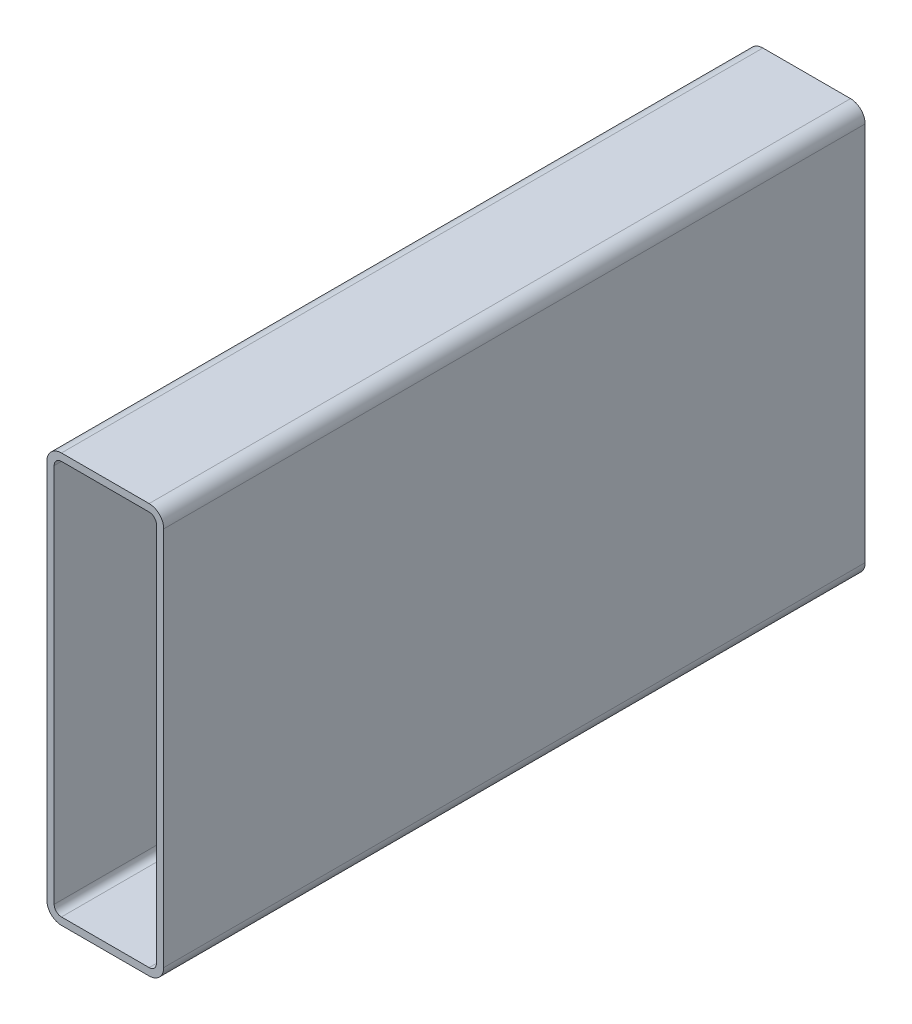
ISO-10303-21;
HEADER;
FILE_DESCRIPTION(('STEP AP214'),'2;1');
FILE_NAME('part.step','',(''),(''),'','','');
FILE_SCHEMA(('AUTOMOTIVE_DESIGN { 1 0 10303 214 1 1 1 1 }'));
ENDSEC;
DATA;
#1=APPLICATION_CONTEXT('core data for automotive mechanical design processes');
#2=APPLICATION_PROTOCOL_DEFINITION('international standard','automotive_design',2000,#1);
#3=PRODUCT_CONTEXT('',#1,'mechanical');
#4=PRODUCT('Part','Part','',(#3));
#5=PRODUCT_RELATED_PRODUCT_CATEGORY('part','',(#4));
#6=PRODUCT_DEFINITION_FORMATION('','',#4);
#7=PRODUCT_DEFINITION_CONTEXT('part definition',#1,'design');
#8=PRODUCT_DEFINITION('design','',#6,#7);
#9=PRODUCT_DEFINITION_SHAPE('','',#8);
#10=(LENGTH_UNIT() NAMED_UNIT(*) SI_UNIT(.MILLI.,.METRE.));
#11=(NAMED_UNIT(*) PLANE_ANGLE_UNIT() SI_UNIT($,.RADIAN.));
#12=(NAMED_UNIT(*) SI_UNIT($,.STERADIAN.) SOLID_ANGLE_UNIT());
#13=UNCERTAINTY_MEASURE_WITH_UNIT(LENGTH_MEASURE(1.E-05),#10,'distance_accuracy_value','');
#14=(GEOMETRIC_REPRESENTATION_CONTEXT(3) GLOBAL_UNCERTAINTY_ASSIGNED_CONTEXT((#13)) GLOBAL_UNIT_ASSIGNED_CONTEXT((#10,
#11,#12)) REPRESENTATION_CONTEXT('',''));
#15=CARTESIAN_POINT('',(0.,0.,0.));
#16=DIRECTION('',(0.,0.,1.));
#17=DIRECTION('',(1.,0.,0.));
#18=AXIS2_PLACEMENT_3D('',#15,#16,#17);
#19=CARTESIAN_POINT('',(6.35,171.45,304.8));
#20=DIRECTION('',(0.,0.,1.));
#21=DIRECTION('',(1.,0.,0.));
#22=AXIS2_PLACEMENT_3D('',#19,#20,#21);
#23=PLANE('',#22);
#24=CARTESIAN_POINT('',(6.35,171.45,304.8));
#25=DIRECTION('',(0.,0.,1.));
#26=DIRECTION('',(1.,0.,0.));
#27=AXIS2_PLACEMENT_3D('',#24,#25,#26);
#28=CIRCLE('',#27,6.35);
#29=CARTESIAN_POINT('',(6.35,177.8,304.8));
#30=VERTEX_POINT('',#29);
#31=CARTESIAN_POINT('',(0.,171.45,304.8));
#32=VERTEX_POINT('',#31);
#33=EDGE_CURVE('E211',#30,#32,#28,.T.);
#34=ORIENTED_EDGE('',*,*,#33,.T.);
#35=DIRECTION('',(0.,-1.,0.));
#36=VECTOR('',#35,1.);
#37=CARTESIAN_POINT('',(0.,6.35,304.8));
#38=LINE('',#37,#36);
#39=CARTESIAN_POINT('',(0.,6.35,304.8));
#40=VERTEX_POINT('',#39);
#41=EDGE_CURVE('E214',#32,#40,#38,.T.);
#42=ORIENTED_EDGE('',*,*,#41,.T.);
#43=CARTESIAN_POINT('',(6.35,6.35,304.8));
#44=DIRECTION('',(0.,0.,1.));
#45=DIRECTION('',(1.,0.,0.));
#46=AXIS2_PLACEMENT_3D('',#43,#44,#45);
#47=CIRCLE('',#46,6.35);
#48=CARTESIAN_POINT('',(6.35,0.,304.8));
#49=VERTEX_POINT('',#48);
#50=EDGE_CURVE('E217',#40,#49,#47,.T.);
#51=ORIENTED_EDGE('',*,*,#50,.T.);
#52=DIRECTION('',(1.,0.,0.));
#53=VECTOR('',#52,1.);
#54=CARTESIAN_POINT('',(44.45,0.,304.8));
#55=LINE('',#54,#53);
#56=CARTESIAN_POINT('',(44.45,0.,304.8));
#57=VERTEX_POINT('',#56);
#58=EDGE_CURVE('E219',#49,#57,#55,.T.);
#59=ORIENTED_EDGE('',*,*,#58,.T.);
#60=CARTESIAN_POINT('',(44.45,6.35,304.8));
#61=DIRECTION('',(0.,0.,1.));
#62=DIRECTION('',(1.,0.,0.));
#63=AXIS2_PLACEMENT_3D('',#60,#61,#62);
#64=CIRCLE('',#63,6.35);
#65=CARTESIAN_POINT('',(50.8,6.35,304.8));
#66=VERTEX_POINT('',#65);
#67=EDGE_CURVE('E221',#57,#66,#64,.T.);
#68=ORIENTED_EDGE('',*,*,#67,.T.);
#69=DIRECTION('',(0.,1.,0.));
#70=VECTOR('',#69,1.);
#71=CARTESIAN_POINT('',(50.8,171.45,304.8));
#72=LINE('',#71,#70);
#73=CARTESIAN_POINT('',(50.8,171.45,304.8));
#74=VERTEX_POINT('',#73);
#75=EDGE_CURVE('E223',#66,#74,#72,.T.);
#76=ORIENTED_EDGE('',*,*,#75,.T.);
#77=CARTESIAN_POINT('',(44.45,171.45,304.8));
#78=DIRECTION('',(0.,0.,1.));
#79=DIRECTION('',(1.,0.,0.));
#80=AXIS2_PLACEMENT_3D('',#77,#78,#79);
#81=CIRCLE('',#80,6.35);
#82=CARTESIAN_POINT('',(44.45,177.8,304.8));
#83=VERTEX_POINT('',#82);
#84=EDGE_CURVE('E225',#74,#83,#81,.T.);
#85=ORIENTED_EDGE('',*,*,#84,.T.);
#86=DIRECTION('',(-1.,0.,0.));
#87=VECTOR('',#86,1.);
#88=CARTESIAN_POINT('',(6.35,177.8,304.8));
#89=LINE('',#88,#87);
#90=EDGE_CURVE('E227',#83,#30,#89,.T.);
#91=ORIENTED_EDGE('',*,*,#90,.T.);
#92=EDGE_LOOP('',(#34,#42,#51,#59,#68,#76,#85,#91));
#93=FACE_BOUND('',#92,.T.);
#94=DIRECTION('',(0.,-1.,0.));
#95=VECTOR('',#94,1.);
#96=CARTESIAN_POINT('',(3.175,6.35,304.8));
#97=LINE('',#96,#95);
#98=CARTESIAN_POINT('',(3.175,171.45,304.8));
#99=VERTEX_POINT('',#98);
#100=CARTESIAN_POINT('',(3.175,6.35,304.8));
#101=VERTEX_POINT('',#100);
#102=EDGE_CURVE('E154',#99,#101,#97,.T.);
#103=ORIENTED_EDGE('',*,*,#102,.F.);
#104=CARTESIAN_POINT('',(6.35,171.45,304.8));
#105=DIRECTION('',(0.,0.,1.));
#106=DIRECTION('',(1.,0.,0.));
#107=AXIS2_PLACEMENT_3D('',#104,#105,#106);
#108=CIRCLE('',#107,3.17500000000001);
#109=CARTESIAN_POINT('',(6.35,174.625,304.8));
#110=VERTEX_POINT('',#109);
#111=EDGE_CURVE('E146',#110,#99,#108,.T.);
#112=ORIENTED_EDGE('',*,*,#111,.F.);
#113=DIRECTION('',(-1.,0.,0.));
#114=VECTOR('',#113,1.);
#115=CARTESIAN_POINT('',(6.35,174.625,304.8));
#116=LINE('',#115,#114);
#117=CARTESIAN_POINT('',(44.45,174.625,304.8));
#118=VERTEX_POINT('',#117);
#119=EDGE_CURVE('E179',#118,#110,#116,.T.);
#120=ORIENTED_EDGE('',*,*,#119,.F.);
#121=CARTESIAN_POINT('',(44.45,171.45,304.8));
#122=DIRECTION('',(0.,0.,1.));
#123=DIRECTION('',(1.,0.,0.));
#124=AXIS2_PLACEMENT_3D('',#121,#122,#123);
#125=CIRCLE('',#124,3.17500000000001);
#126=CARTESIAN_POINT('',(47.625,171.45,304.8));
#127=VERTEX_POINT('',#126);
#128=EDGE_CURVE('E177',#127,#118,#125,.T.);
#129=ORIENTED_EDGE('',*,*,#128,.F.);
#130=DIRECTION('',(0.,1.,0.));
#131=VECTOR('',#130,1.);
#132=CARTESIAN_POINT('',(47.625,171.45,304.8));
#133=LINE('',#132,#131);
#134=CARTESIAN_POINT('',(47.625,6.35,304.8));
#135=VERTEX_POINT('',#134);
#136=EDGE_CURVE('E175',#135,#127,#133,.T.);
#137=ORIENTED_EDGE('',*,*,#136,.F.);
#138=CARTESIAN_POINT('',(44.45,6.35,304.8));
#139=DIRECTION('',(0.,0.,1.));
#140=DIRECTION('',(1.,0.,0.));
#141=AXIS2_PLACEMENT_3D('',#138,#139,#140);
#142=CIRCLE('',#141,3.175);
#143=CARTESIAN_POINT('',(44.45,3.175,304.8));
#144=VERTEX_POINT('',#143);
#145=EDGE_CURVE('E173',#144,#135,#142,.T.);
#146=ORIENTED_EDGE('',*,*,#145,.F.);
#147=DIRECTION('',(1.,0.,0.));
#148=VECTOR('',#147,1.);
#149=CARTESIAN_POINT('',(44.45,3.175,304.8));
#150=LINE('',#149,#148);
#151=CARTESIAN_POINT('',(6.35,3.175,304.8));
#152=VERTEX_POINT('',#151);
#153=EDGE_CURVE('E169',#152,#144,#150,.T.);
#154=ORIENTED_EDGE('',*,*,#153,.F.);
#155=CARTESIAN_POINT('',(6.35,6.35,304.8));
#156=DIRECTION('',(0.,0.,1.));
#157=DIRECTION('',(1.,0.,0.));
#158=AXIS2_PLACEMENT_3D('',#155,#156,#157);
#159=CIRCLE('',#158,3.175);
#160=EDGE_CURVE('E167',#101,#152,#159,.T.);
#161=ORIENTED_EDGE('',*,*,#160,.F.);
#162=EDGE_LOOP('',(#103,#112,#120,#129,#137,#146,#154,#161));
#163=FACE_BOUND('',#162,.T.);
#164=ADVANCED_FACE('F33',(#93,#163),#23,.T.);
#165=CARTESIAN_POINT('',(6.35,171.45,0.));
#166=DIRECTION('',(0.,0.,1.));
#167=DIRECTION('',(1.,0.,0.));
#168=AXIS2_PLACEMENT_3D('',#165,#166,#167);
#169=PLANE('',#168);
#170=CARTESIAN_POINT('',(6.35,171.45,0.));
#171=DIRECTION('',(0.,0.,1.));
#172=DIRECTION('',(1.,0.,0.));
#173=AXIS2_PLACEMENT_3D('',#170,#171,#172);
#174=CIRCLE('',#173,6.35);
#175=CARTESIAN_POINT('',(6.35,177.8,0.));
#176=VERTEX_POINT('',#175);
#177=CARTESIAN_POINT('',(0.,171.45,0.));
#178=VERTEX_POINT('',#177);
#179=EDGE_CURVE('E162',#176,#178,#174,.T.);
#180=ORIENTED_EDGE('',*,*,#179,.F.);
#181=DIRECTION('',(-1.,0.,0.));
#182=VECTOR('',#181,1.);
#183=CARTESIAN_POINT('',(6.35,177.8,0.));
#184=LINE('',#183,#182);
#185=CARTESIAN_POINT('',(44.45,177.8,0.));
#186=VERTEX_POINT('',#185);
#187=EDGE_CURVE('E215',#186,#176,#184,.T.);
#188=ORIENTED_EDGE('',*,*,#187,.F.);
#189=CARTESIAN_POINT('',(44.45,171.45,0.));
#190=DIRECTION('',(0.,0.,1.));
#191=DIRECTION('',(1.,0.,0.));
#192=AXIS2_PLACEMENT_3D('',#189,#190,#191);
#193=CIRCLE('',#192,6.35);
#194=CARTESIAN_POINT('',(50.8,171.45,0.));
#195=VERTEX_POINT('',#194);
#196=EDGE_CURVE('E242',#195,#186,#193,.T.);
#197=ORIENTED_EDGE('',*,*,#196,.F.);
#198=DIRECTION('',(0.,1.,0.));
#199=VECTOR('',#198,1.);
#200=CARTESIAN_POINT('',(50.8,171.45,0.));
#201=LINE('',#200,#199);
#202=CARTESIAN_POINT('',(50.8,6.35,0.));
#203=VERTEX_POINT('',#202);
#204=EDGE_CURVE('E240',#203,#195,#201,.T.);
#205=ORIENTED_EDGE('',*,*,#204,.F.);
#206=CARTESIAN_POINT('',(44.45,6.35,0.));
#207=DIRECTION('',(0.,0.,1.));
#208=DIRECTION('',(1.,0.,0.));
#209=AXIS2_PLACEMENT_3D('',#206,#207,#208);
#210=CIRCLE('',#209,6.35);
#211=CARTESIAN_POINT('',(44.45,0.,0.));
#212=VERTEX_POINT('',#211);
#213=EDGE_CURVE('E238',#212,#203,#210,.T.);
#214=ORIENTED_EDGE('',*,*,#213,.F.);
#215=DIRECTION('',(1.,0.,0.));
#216=VECTOR('',#215,1.);
#217=CARTESIAN_POINT('',(44.45,0.,0.));
#218=LINE('',#217,#216);
#219=CARTESIAN_POINT('',(6.35,0.,0.));
#220=VERTEX_POINT('',#219);
#221=EDGE_CURVE('E236',#220,#212,#218,.T.);
#222=ORIENTED_EDGE('',*,*,#221,.F.);
#223=CARTESIAN_POINT('',(6.35,6.35,0.));
#224=DIRECTION('',(0.,0.,1.));
#225=DIRECTION('',(1.,0.,0.));
#226=AXIS2_PLACEMENT_3D('',#223,#224,#225);
#227=CIRCLE('',#226,6.35);
#228=CARTESIAN_POINT('',(0.,6.35,0.));
#229=VERTEX_POINT('',#228);
#230=EDGE_CURVE('E234',#229,#220,#227,.T.);
#231=ORIENTED_EDGE('',*,*,#230,.F.);
#232=DIRECTION('',(0.,-1.,0.));
#233=VECTOR('',#232,1.);
#234=CARTESIAN_POINT('',(0.,6.35,0.));
#235=LINE('',#234,#233);
#236=EDGE_CURVE('E232',#178,#229,#235,.T.);
#237=ORIENTED_EDGE('',*,*,#236,.F.);
#238=EDGE_LOOP('',(#180,#188,#197,#205,#214,#222,#231,#237));
#239=FACE_BOUND('',#238,.T.);
#240=CARTESIAN_POINT('',(6.35,171.45,0.));
#241=DIRECTION('',(0.,0.,1.));
#242=DIRECTION('',(1.,0.,0.));
#243=AXIS2_PLACEMENT_3D('',#240,#241,#242);
#244=CIRCLE('',#243,3.17500000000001);
#245=CARTESIAN_POINT('',(6.35,174.625,0.));
#246=VERTEX_POINT('',#245);
#247=CARTESIAN_POINT('',(3.175,171.45,0.));
#248=VERTEX_POINT('',#247);
#249=EDGE_CURVE('E56',#246,#248,#244,.T.);
#250=ORIENTED_EDGE('',*,*,#249,.T.);
#251=DIRECTION('',(0.,-1.,0.));
#252=VECTOR('',#251,1.);
#253=CARTESIAN_POINT('',(3.175,6.35,0.));
#254=LINE('',#253,#252);
#255=CARTESIAN_POINT('',(3.175,6.35,0.));
#256=VERTEX_POINT('',#255);
#257=EDGE_CURVE('E161',#248,#256,#254,.T.);
#258=ORIENTED_EDGE('',*,*,#257,.T.);
#259=CARTESIAN_POINT('',(6.35,6.35,0.));
#260=DIRECTION('',(0.,0.,1.));
#261=DIRECTION('',(1.,0.,0.));
#262=AXIS2_PLACEMENT_3D('',#259,#260,#261);
#263=CIRCLE('',#262,3.175);
#264=CARTESIAN_POINT('',(6.35,3.175,0.));
#265=VERTEX_POINT('',#264);
#266=EDGE_CURVE('E183',#256,#265,#263,.T.);
#267=ORIENTED_EDGE('',*,*,#266,.T.);
#268=DIRECTION('',(1.,0.,0.));
#269=VECTOR('',#268,1.);
#270=CARTESIAN_POINT('',(44.45,3.175,0.));
#271=LINE('',#270,#269);
#272=CARTESIAN_POINT('',(44.45,3.175,0.));
#273=VERTEX_POINT('',#272);
#274=EDGE_CURVE('E186',#265,#273,#271,.T.);
#275=ORIENTED_EDGE('',*,*,#274,.T.);
#276=CARTESIAN_POINT('',(44.45,6.35,0.));
#277=DIRECTION('',(0.,0.,1.));
#278=DIRECTION('',(1.,0.,0.));
#279=AXIS2_PLACEMENT_3D('',#276,#277,#278);
#280=CIRCLE('',#279,3.175);
#281=CARTESIAN_POINT('',(47.625,6.35,0.));
#282=VERTEX_POINT('',#281);
#283=EDGE_CURVE('E189',#273,#282,#280,.T.);
#284=ORIENTED_EDGE('',*,*,#283,.T.);
#285=DIRECTION('',(0.,1.,0.));
#286=VECTOR('',#285,1.);
#287=CARTESIAN_POINT('',(47.625,171.45,0.));
#288=LINE('',#287,#286);
#289=CARTESIAN_POINT('',(47.625,171.45,0.));
#290=VERTEX_POINT('',#289);
#291=EDGE_CURVE('E192',#282,#290,#288,.T.);
#292=ORIENTED_EDGE('',*,*,#291,.T.);
#293=CARTESIAN_POINT('',(44.45,171.45,0.));
#294=DIRECTION('',(0.,0.,1.));
#295=DIRECTION('',(1.,0.,0.));
#296=AXIS2_PLACEMENT_3D('',#293,#294,#295);
#297=CIRCLE('',#296,3.17500000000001);
#298=CARTESIAN_POINT('',(44.45,174.625,0.));
#299=VERTEX_POINT('',#298);
#300=EDGE_CURVE('E195',#290,#299,#297,.T.);
#301=ORIENTED_EDGE('',*,*,#300,.T.);
#302=DIRECTION('',(-1.,0.,0.));
#303=VECTOR('',#302,1.);
#304=CARTESIAN_POINT('',(6.35,174.625,0.));
#305=LINE('',#304,#303);
#306=EDGE_CURVE('E155',#299,#246,#305,.T.);
#307=ORIENTED_EDGE('',*,*,#306,.T.);
#308=EDGE_LOOP('',(#250,#258,#267,#275,#284,#292,#301,#307));
#309=FACE_BOUND('',#308,.T.);
#310=ADVANCED_FACE('F272',(#239,#309),#169,.F.);
#311=CARTESIAN_POINT('',(6.35,171.45,304.8));
#312=DIRECTION('',(0.,0.,-1.));
#313=DIRECTION('',(-1.,0.,0.));
#314=AXIS2_PLACEMENT_3D('',#311,#312,#313);
#315=CYLINDRICAL_SURFACE('',#314,6.35);
#316=ORIENTED_EDGE('',*,*,#179,.T.);
#317=DIRECTION('',(0.,0.,-1.));
#318=VECTOR('',#317,1.);
#319=CARTESIAN_POINT('',(0.,171.45,304.8));
#320=LINE('',#319,#318);
#321=EDGE_CURVE('E11',#32,#178,#320,.T.);
#322=ORIENTED_EDGE('',*,*,#321,.F.);
#323=ORIENTED_EDGE('',*,*,#33,.F.);
#324=DIRECTION('',(0.,0.,-1.));
#325=VECTOR('',#324,1.);
#326=CARTESIAN_POINT('',(6.35,177.8,304.8));
#327=LINE('',#326,#325);
#328=EDGE_CURVE('E229',#30,#176,#327,.T.);
#329=ORIENTED_EDGE('',*,*,#328,.T.);
#330=EDGE_LOOP('',(#316,#322,#323,#329));
#331=FACE_BOUND('',#330,.T.);
#332=ADVANCED_FACE('F35',(#331),#315,.T.);
#333=CARTESIAN_POINT('',(0.,6.35,304.8));
#334=DIRECTION('',(1.,0.,0.));
#335=DIRECTION('',(0.,0.,-1.));
#336=AXIS2_PLACEMENT_3D('',#333,#334,#335);
#337=PLANE('',#336);
#338=ORIENTED_EDGE('',*,*,#236,.T.);
#339=DIRECTION('',(0.,0.,-1.));
#340=VECTOR('',#339,1.);
#341=CARTESIAN_POINT('',(0.,6.35,304.8));
#342=LINE('',#341,#340);
#343=EDGE_CURVE('E41',#40,#229,#342,.T.);
#344=ORIENTED_EDGE('',*,*,#343,.F.);
#345=ORIENTED_EDGE('',*,*,#41,.F.);
#346=ORIENTED_EDGE('',*,*,#321,.T.);
#347=EDGE_LOOP('',(#338,#344,#345,#346));
#348=FACE_BOUND('',#347,.T.);
#349=ADVANCED_FACE('F289',(#348),#337,.F.);
#350=CARTESIAN_POINT('',(6.35,6.35,304.8));
#351=DIRECTION('',(0.,0.,-1.));
#352=DIRECTION('',(-1.,0.,0.));
#353=AXIS2_PLACEMENT_3D('',#350,#351,#352);
#354=CYLINDRICAL_SURFACE('',#353,6.35);
#355=ORIENTED_EDGE('',*,*,#230,.T.);
#356=DIRECTION('',(0.,0.,-1.));
#357=VECTOR('',#356,1.);
#358=CARTESIAN_POINT('',(6.35,0.,304.8));
#359=LINE('',#358,#357);
#360=EDGE_CURVE('E259',#49,#220,#359,.T.);
#361=ORIENTED_EDGE('',*,*,#360,.F.);
#362=ORIENTED_EDGE('',*,*,#50,.F.);
#363=ORIENTED_EDGE('',*,*,#343,.T.);
#364=EDGE_LOOP('',(#355,#361,#362,#363));
#365=FACE_BOUND('',#364,.T.);
#366=ADVANCED_FACE('F266',(#365),#354,.T.);
#367=CARTESIAN_POINT('',(44.45,0.,304.8));
#368=DIRECTION('',(0.,1.,0.));
#369=DIRECTION('',(0.,0.,1.));
#370=AXIS2_PLACEMENT_3D('',#367,#368,#369);
#371=PLANE('',#370);
#372=ORIENTED_EDGE('',*,*,#221,.T.);
#373=DIRECTION('',(0.,0.,-1.));
#374=VECTOR('',#373,1.);
#375=CARTESIAN_POINT('',(44.45,0.,304.8));
#376=LINE('',#375,#374);
#377=EDGE_CURVE('E256',#57,#212,#376,.T.);
#378=ORIENTED_EDGE('',*,*,#377,.F.);
#379=ORIENTED_EDGE('',*,*,#58,.F.);
#380=ORIENTED_EDGE('',*,*,#360,.T.);
#381=EDGE_LOOP('',(#372,#378,#379,#380));
#382=FACE_BOUND('',#381,.T.);
#383=ADVANCED_FACE('F278',(#382),#371,.F.);
#384=CARTESIAN_POINT('',(44.45,6.35,304.8));
#385=DIRECTION('',(0.,0.,-1.));
#386=DIRECTION('',(-1.,0.,0.));
#387=AXIS2_PLACEMENT_3D('',#384,#385,#386);
#388=CYLINDRICAL_SURFACE('',#387,6.35);
#389=ORIENTED_EDGE('',*,*,#213,.T.);
#390=DIRECTION('',(0.,0.,-1.));
#391=VECTOR('',#390,1.);
#392=CARTESIAN_POINT('',(50.8,6.35,304.8));
#393=LINE('',#392,#391);
#394=EDGE_CURVE('E253',#66,#203,#393,.T.);
#395=ORIENTED_EDGE('',*,*,#394,.F.);
#396=ORIENTED_EDGE('',*,*,#67,.F.);
#397=ORIENTED_EDGE('',*,*,#377,.T.);
#398=EDGE_LOOP('',(#389,#395,#396,#397));
#399=FACE_BOUND('',#398,.T.);
#400=ADVANCED_FACE('F282',(#399),#388,.T.);
#401=CARTESIAN_POINT('',(50.8,171.45,304.8));
#402=DIRECTION('',(-1.,0.,0.));
#403=DIRECTION('',(0.,0.,1.));
#404=AXIS2_PLACEMENT_3D('',#401,#402,#403);
#405=PLANE('',#404);
#406=ORIENTED_EDGE('',*,*,#204,.T.);
#407=DIRECTION('',(0.,0.,-1.));
#408=VECTOR('',#407,1.);
#409=CARTESIAN_POINT('',(50.8,171.45,304.8));
#410=LINE('',#409,#408);
#411=EDGE_CURVE('E250',#74,#195,#410,.T.);
#412=ORIENTED_EDGE('',*,*,#411,.F.);
#413=ORIENTED_EDGE('',*,*,#75,.F.);
#414=ORIENTED_EDGE('',*,*,#394,.T.);
#415=EDGE_LOOP('',(#406,#412,#413,#414));
#416=FACE_BOUND('',#415,.T.);
#417=ADVANCED_FACE('F302',(#416),#405,.F.);
#418=CARTESIAN_POINT('',(44.45,171.45,304.8));
#419=DIRECTION('',(0.,0.,-1.));
#420=DIRECTION('',(-1.,0.,0.));
#421=AXIS2_PLACEMENT_3D('',#418,#419,#420);
#422=CYLINDRICAL_SURFACE('',#421,6.35);
#423=ORIENTED_EDGE('',*,*,#196,.T.);
#424=DIRECTION('',(0.,0.,-1.));
#425=VECTOR('',#424,1.);
#426=CARTESIAN_POINT('',(44.45,177.8,304.8));
#427=LINE('',#426,#425);
#428=EDGE_CURVE('E247',#83,#186,#427,.T.);
#429=ORIENTED_EDGE('',*,*,#428,.F.);
#430=ORIENTED_EDGE('',*,*,#84,.F.);
#431=ORIENTED_EDGE('',*,*,#411,.T.);
#432=EDGE_LOOP('',(#423,#429,#430,#431));
#433=FACE_BOUND('',#432,.T.);
#434=ADVANCED_FACE('F300',(#433),#422,.T.);
#435=CARTESIAN_POINT('',(6.35,177.8,304.8));
#436=DIRECTION('',(0.,-1.,0.));
#437=DIRECTION('',(0.,0.,-1.));
#438=AXIS2_PLACEMENT_3D('',#435,#436,#437);
#439=PLANE('',#438);
#440=ORIENTED_EDGE('',*,*,#187,.T.);
#441=ORIENTED_EDGE('',*,*,#328,.F.);
#442=ORIENTED_EDGE('',*,*,#90,.F.);
#443=ORIENTED_EDGE('',*,*,#428,.T.);
#444=EDGE_LOOP('',(#440,#441,#442,#443));
#445=FACE_BOUND('',#444,.T.);
#446=ADVANCED_FACE('F295',(#445),#439,.F.);
#447=CARTESIAN_POINT('',(6.35,171.45,304.8));
#448=DIRECTION('',(0.,0.,-1.));
#449=DIRECTION('',(-1.,0.,0.));
#450=AXIS2_PLACEMENT_3D('',#447,#448,#449);
#451=CYLINDRICAL_SURFACE('',#450,3.17500000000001);
#452=ORIENTED_EDGE('',*,*,#249,.F.);
#453=DIRECTION('',(0.,0.,-1.));
#454=VECTOR('',#453,1.);
#455=CARTESIAN_POINT('',(6.35,174.625,304.8));
#456=LINE('',#455,#454);
#457=EDGE_CURVE('E150',#110,#246,#456,.T.);
#458=ORIENTED_EDGE('',*,*,#457,.F.);
#459=ORIENTED_EDGE('',*,*,#111,.T.);
#460=DIRECTION('',(0.,0.,-1.));
#461=VECTOR('',#460,1.);
#462=CARTESIAN_POINT('',(3.175,171.45,304.8));
#463=LINE('',#462,#461);
#464=EDGE_CURVE('E149',#99,#248,#463,.T.);
#465=ORIENTED_EDGE('',*,*,#464,.T.);
#466=EDGE_LOOP('',(#452,#458,#459,#465));
#467=FACE_BOUND('',#466,.T.);
#468=ADVANCED_FACE('F148',(#467),#451,.F.);
#469=CARTESIAN_POINT('',(3.175,6.35,304.8));
#470=DIRECTION('',(1.,0.,0.));
#471=DIRECTION('',(0.,0.,-1.));
#472=AXIS2_PLACEMENT_3D('',#469,#470,#471);
#473=PLANE('',#472);
#474=ORIENTED_EDGE('',*,*,#257,.F.);
#475=ORIENTED_EDGE('',*,*,#464,.F.);
#476=ORIENTED_EDGE('',*,*,#102,.T.);
#477=DIRECTION('',(0.,0.,-1.));
#478=VECTOR('',#477,1.);
#479=CARTESIAN_POINT('',(3.175,6.35,304.8));
#480=LINE('',#479,#478);
#481=EDGE_CURVE('E163',#101,#256,#480,.T.);
#482=ORIENTED_EDGE('',*,*,#481,.T.);
#483=EDGE_LOOP('',(#474,#475,#476,#482));
#484=FACE_BOUND('',#483,.T.);
#485=ADVANCED_FACE('F158',(#484),#473,.T.);
#486=CARTESIAN_POINT('',(6.35,6.35,304.8));
#487=DIRECTION('',(0.,0.,-1.));
#488=DIRECTION('',(-1.,0.,0.));
#489=AXIS2_PLACEMENT_3D('',#486,#487,#488);
#490=CYLINDRICAL_SURFACE('',#489,3.175);
#491=ORIENTED_EDGE('',*,*,#266,.F.);
#492=ORIENTED_EDGE('',*,*,#481,.F.);
#493=ORIENTED_EDGE('',*,*,#160,.T.);
#494=DIRECTION('',(0.,0.,-1.));
#495=VECTOR('',#494,1.);
#496=CARTESIAN_POINT('',(6.35,3.175,304.8));
#497=LINE('',#496,#495);
#498=EDGE_CURVE('E208',#152,#265,#497,.T.);
#499=ORIENTED_EDGE('',*,*,#498,.T.);
#500=EDGE_LOOP('',(#491,#492,#493,#499));
#501=FACE_BOUND('',#500,.T.);
#502=ADVANCED_FACE('F327',(#501),#490,.F.);
#503=CARTESIAN_POINT('',(44.45,3.175,304.8));
#504=DIRECTION('',(0.,1.,0.));
#505=DIRECTION('',(0.,0.,1.));
#506=AXIS2_PLACEMENT_3D('',#503,#504,#505);
#507=PLANE('',#506);
#508=ORIENTED_EDGE('',*,*,#274,.F.);
#509=ORIENTED_EDGE('',*,*,#498,.F.);
#510=ORIENTED_EDGE('',*,*,#153,.T.);
#511=DIRECTION('',(0.,0.,-1.));
#512=VECTOR('',#511,1.);
#513=CARTESIAN_POINT('',(44.45,3.175,304.8));
#514=LINE('',#513,#512);
#515=EDGE_CURVE('E206',#144,#273,#514,.T.);
#516=ORIENTED_EDGE('',*,*,#515,.T.);
#517=EDGE_LOOP('',(#508,#509,#510,#516));
#518=FACE_BOUND('',#517,.T.);
#519=ADVANCED_FACE('F331',(#518),#507,.T.);
#520=CARTESIAN_POINT('',(44.45,6.35,304.8));
#521=DIRECTION('',(0.,0.,-1.));
#522=DIRECTION('',(-1.,0.,0.));
#523=AXIS2_PLACEMENT_3D('',#520,#521,#522);
#524=CYLINDRICAL_SURFACE('',#523,3.175);
#525=ORIENTED_EDGE('',*,*,#283,.F.);
#526=ORIENTED_EDGE('',*,*,#515,.F.);
#527=ORIENTED_EDGE('',*,*,#145,.T.);
#528=DIRECTION('',(0.,0.,-1.));
#529=VECTOR('',#528,1.);
#530=CARTESIAN_POINT('',(47.625,6.35,304.8));
#531=LINE('',#530,#529);
#532=EDGE_CURVE('E204',#135,#282,#531,.T.);
#533=ORIENTED_EDGE('',*,*,#532,.T.);
#534=EDGE_LOOP('',(#525,#526,#527,#533));
#535=FACE_BOUND('',#534,.T.);
#536=ADVANCED_FACE('F337',(#535),#524,.F.);
#537=CARTESIAN_POINT('',(47.625,171.45,304.8));
#538=DIRECTION('',(-1.,0.,0.));
#539=DIRECTION('',(0.,0.,1.));
#540=AXIS2_PLACEMENT_3D('',#537,#538,#539);
#541=PLANE('',#540);
#542=ORIENTED_EDGE('',*,*,#291,.F.);
#543=ORIENTED_EDGE('',*,*,#532,.F.);
#544=ORIENTED_EDGE('',*,*,#136,.T.);
#545=DIRECTION('',(0.,0.,-1.));
#546=VECTOR('',#545,1.);
#547=CARTESIAN_POINT('',(47.625,171.45,304.8));
#548=LINE('',#547,#546);
#549=EDGE_CURVE('E202',#127,#290,#548,.T.);
#550=ORIENTED_EDGE('',*,*,#549,.T.);
#551=EDGE_LOOP('',(#542,#543,#544,#550));
#552=FACE_BOUND('',#551,.T.);
#553=ADVANCED_FACE('F341',(#552),#541,.T.);
#554=CARTESIAN_POINT('',(44.45,171.45,304.8));
#555=DIRECTION('',(0.,0.,-1.));
#556=DIRECTION('',(-1.,0.,0.));
#557=AXIS2_PLACEMENT_3D('',#554,#555,#556);
#558=CYLINDRICAL_SURFACE('',#557,3.17500000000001);
#559=ORIENTED_EDGE('',*,*,#300,.F.);
#560=ORIENTED_EDGE('',*,*,#549,.F.);
#561=ORIENTED_EDGE('',*,*,#128,.T.);
#562=DIRECTION('',(0.,0.,-1.));
#563=VECTOR('',#562,1.);
#564=CARTESIAN_POINT('',(44.45,174.625,304.8));
#565=LINE('',#564,#563);
#566=EDGE_CURVE('E48',#118,#299,#565,.T.);
#567=ORIENTED_EDGE('',*,*,#566,.T.);
#568=EDGE_LOOP('',(#559,#560,#561,#567));
#569=FACE_BOUND('',#568,.T.);
#570=ADVANCED_FACE('F345',(#569),#558,.F.);
#571=CARTESIAN_POINT('',(6.35,174.625,304.8));
#572=DIRECTION('',(0.,-1.,0.));
#573=DIRECTION('',(0.,0.,-1.));
#574=AXIS2_PLACEMENT_3D('',#571,#572,#573);
#575=PLANE('',#574);
#576=ORIENTED_EDGE('',*,*,#306,.F.);
#577=ORIENTED_EDGE('',*,*,#566,.F.);
#578=ORIENTED_EDGE('',*,*,#119,.T.);
#579=ORIENTED_EDGE('',*,*,#457,.T.);
#580=EDGE_LOOP('',(#576,#577,#578,#579));
#581=FACE_BOUND('',#580,.T.);
#582=ADVANCED_FACE('F349',(#581),#575,.T.);
#583=CLOSED_SHELL('',(#164,#310,#332,#349,#366,#383,#400,#417,#434,#446,#468,#485,#502,#519,
#536,#553,#570,#582));
#584=MANIFOLD_SOLID_BREP('B2',#583);
#585=ADVANCED_BREP_SHAPE_REPRESENTATION('',(#18,#584),#14);
#586=SHAPE_DEFINITION_REPRESENTATION(#9,#585);
ENDSEC;
END-ISO-10303-21;
